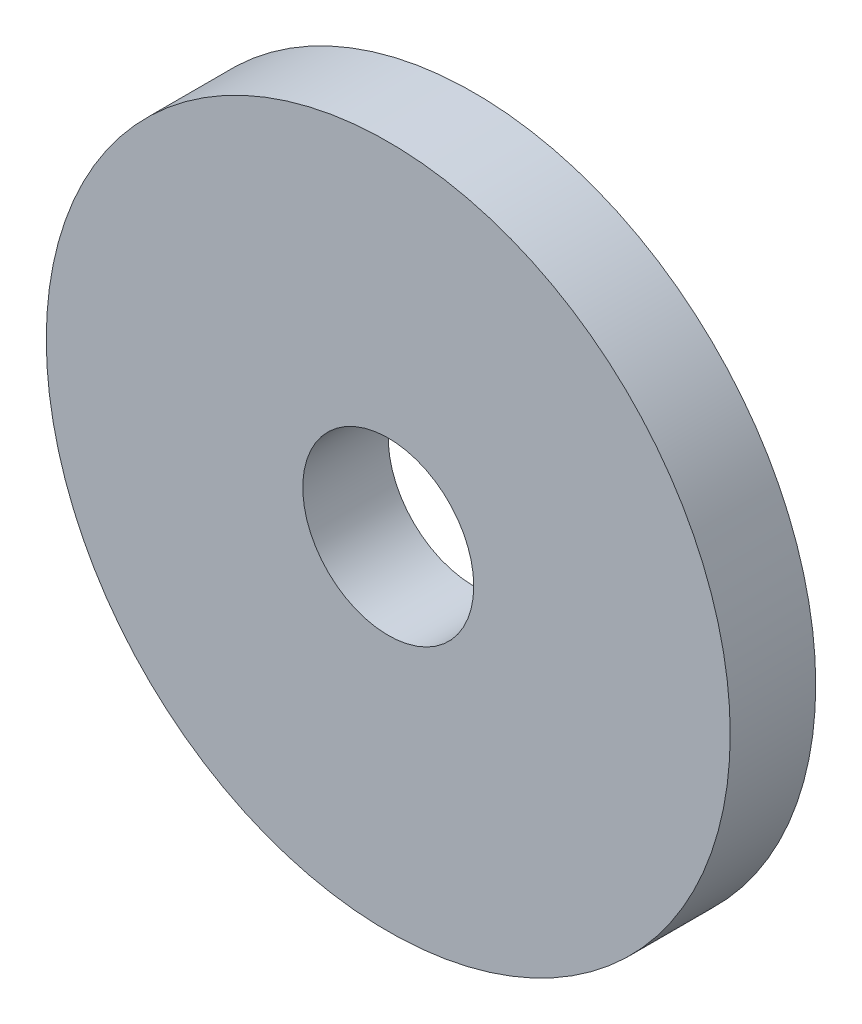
ISO-10303-21;
HEADER;
FILE_DESCRIPTION(('STEP AP214'),'2;1');
FILE_NAME('part.step','',(''),(''),'','','');
FILE_SCHEMA(('AUTOMOTIVE_DESIGN { 1 0 10303 214 1 1 1 1 }'));
ENDSEC;
DATA;
#1=APPLICATION_CONTEXT('core data for automotive mechanical design processes');
#2=APPLICATION_PROTOCOL_DEFINITION('international standard','automotive_design',2000,#1);
#3=PRODUCT_CONTEXT('',#1,'mechanical');
#4=PRODUCT('Part','Part','',(#3));
#5=PRODUCT_RELATED_PRODUCT_CATEGORY('part','',(#4));
#6=PRODUCT_DEFINITION_FORMATION('','',#4);
#7=PRODUCT_DEFINITION_CONTEXT('part definition',#1,'design');
#8=PRODUCT_DEFINITION('design','',#6,#7);
#9=PRODUCT_DEFINITION_SHAPE('','',#8);
#10=(LENGTH_UNIT() NAMED_UNIT(*) SI_UNIT(.MILLI.,.METRE.));
#11=(NAMED_UNIT(*) PLANE_ANGLE_UNIT() SI_UNIT($,.RADIAN.));
#12=(NAMED_UNIT(*) SI_UNIT($,.STERADIAN.) SOLID_ANGLE_UNIT());
#13=UNCERTAINTY_MEASURE_WITH_UNIT(LENGTH_MEASURE(1.E-05),#10,'distance_accuracy_value','');
#14=(GEOMETRIC_REPRESENTATION_CONTEXT(3) GLOBAL_UNCERTAINTY_ASSIGNED_CONTEXT((#13)) GLOBAL_UNIT_ASSIGNED_CONTEXT((#10,
#11,#12)) REPRESENTATION_CONTEXT('',''));
#15=CARTESIAN_POINT('',(0.,0.,0.));
#16=DIRECTION('',(0.,0.,1.));
#17=DIRECTION('',(1.,0.,0.));
#18=AXIS2_PLACEMENT_3D('',#15,#16,#17);
#19=CARTESIAN_POINT('',(0.,0.,3.175));
#20=DIRECTION('',(0.,0.,1.));
#21=DIRECTION('',(1.,0.,0.));
#22=AXIS2_PLACEMENT_3D('',#19,#20,#21);
#23=PLANE('',#22);
#24=CARTESIAN_POINT('',(0.,0.,3.175));
#25=DIRECTION('',(0.,0.,1.));
#26=DIRECTION('',(1.,0.,0.));
#27=AXIS2_PLACEMENT_3D('',#24,#25,#26);
#28=CIRCLE('',#27,12.7);
#29=CARTESIAN_POINT('',(12.7,0.,3.175));
#30=VERTEX_POINT('',#29);
#31=EDGE_CURVE('E10',#30,#30,#28,.T.);
#32=ORIENTED_EDGE('',*,*,#31,.T.);
#33=EDGE_LOOP('',(#32));
#34=FACE_BOUND('',#33,.T.);
#35=CARTESIAN_POINT('',(0.,0.,3.175));
#36=DIRECTION('',(0.,0.,1.));
#37=DIRECTION('',(1.,0.,0.));
#38=AXIS2_PLACEMENT_3D('',#35,#36,#37);
#39=CIRCLE('',#38,3.175);
#40=CARTESIAN_POINT('',(3.175,0.,3.175));
#41=VERTEX_POINT('',#40);
#42=EDGE_CURVE('E41',#41,#41,#39,.T.);
#43=ORIENTED_EDGE('',*,*,#42,.F.);
#44=EDGE_LOOP('',(#43));
#45=FACE_BOUND('',#44,.T.);
#46=ADVANCED_FACE('F30',(#34,#45),#23,.T.);
#47=CARTESIAN_POINT('',(0.,0.,0.));
#48=DIRECTION('',(0.,0.,1.));
#49=DIRECTION('',(1.,0.,0.));
#50=AXIS2_PLACEMENT_3D('',#47,#48,#49);
#51=PLANE('',#50);
#52=CARTESIAN_POINT('',(0.,0.,0.));
#53=DIRECTION('',(0.,0.,1.));
#54=DIRECTION('',(1.,0.,0.));
#55=AXIS2_PLACEMENT_3D('',#52,#53,#54);
#56=CIRCLE('',#55,12.7);
#57=CARTESIAN_POINT('',(12.7,0.,0.));
#58=VERTEX_POINT('',#57);
#59=EDGE_CURVE('E34',#58,#58,#56,.T.);
#60=ORIENTED_EDGE('',*,*,#59,.F.);
#61=EDGE_LOOP('',(#60));
#62=FACE_BOUND('',#61,.T.);
#63=CARTESIAN_POINT('',(0.,0.,0.));
#64=DIRECTION('',(0.,0.,1.));
#65=DIRECTION('',(1.,0.,0.));
#66=AXIS2_PLACEMENT_3D('',#63,#64,#65);
#67=CIRCLE('',#66,3.175);
#68=CARTESIAN_POINT('',(3.175,0.,0.));
#69=VERTEX_POINT('',#68);
#70=EDGE_CURVE('E43',#69,#69,#67,.T.);
#71=ORIENTED_EDGE('',*,*,#70,.T.);
#72=EDGE_LOOP('',(#71));
#73=FACE_BOUND('',#72,.T.);
#74=ADVANCED_FACE('F53',(#62,#73),#51,.F.);
#75=CARTESIAN_POINT('',(0.,0.,3.175));
#76=DIRECTION('',(0.,0.,-1.));
#77=DIRECTION('',(-1.,0.,0.));
#78=AXIS2_PLACEMENT_3D('',#75,#76,#77);
#79=CYLINDRICAL_SURFACE('',#78,12.7);
#80=ORIENTED_EDGE('',*,*,#31,.F.);
#81=EDGE_LOOP('',(#80));
#82=FACE_BOUND('',#81,.T.);
#83=ORIENTED_EDGE('',*,*,#59,.T.);
#84=EDGE_LOOP('',(#83));
#85=FACE_BOUND('',#84,.T.);
#86=ADVANCED_FACE('F32',(#82,#85),#79,.T.);
#87=CARTESIAN_POINT('',(0.,0.,3.175));
#88=DIRECTION('',(0.,0.,-1.));
#89=DIRECTION('',(-1.,0.,0.));
#90=AXIS2_PLACEMENT_3D('',#87,#88,#89);
#91=CYLINDRICAL_SURFACE('',#90,3.175);
#92=ORIENTED_EDGE('',*,*,#42,.T.);
#93=EDGE_LOOP('',(#92));
#94=FACE_BOUND('',#93,.T.);
#95=ORIENTED_EDGE('',*,*,#70,.F.);
#96=EDGE_LOOP('',(#95));
#97=FACE_BOUND('',#96,.T.);
#98=ADVANCED_FACE('F49',(#94,#97),#91,.F.);
#99=CLOSED_SHELL('',(#46,#74,#86,#98));
#100=MANIFOLD_SOLID_BREP('B2',#99);
#101=ADVANCED_BREP_SHAPE_REPRESENTATION('',(#18,#100),#14);
#102=SHAPE_DEFINITION_REPRESENTATION(#9,#101);
ENDSEC;
END-ISO-10303-21;
